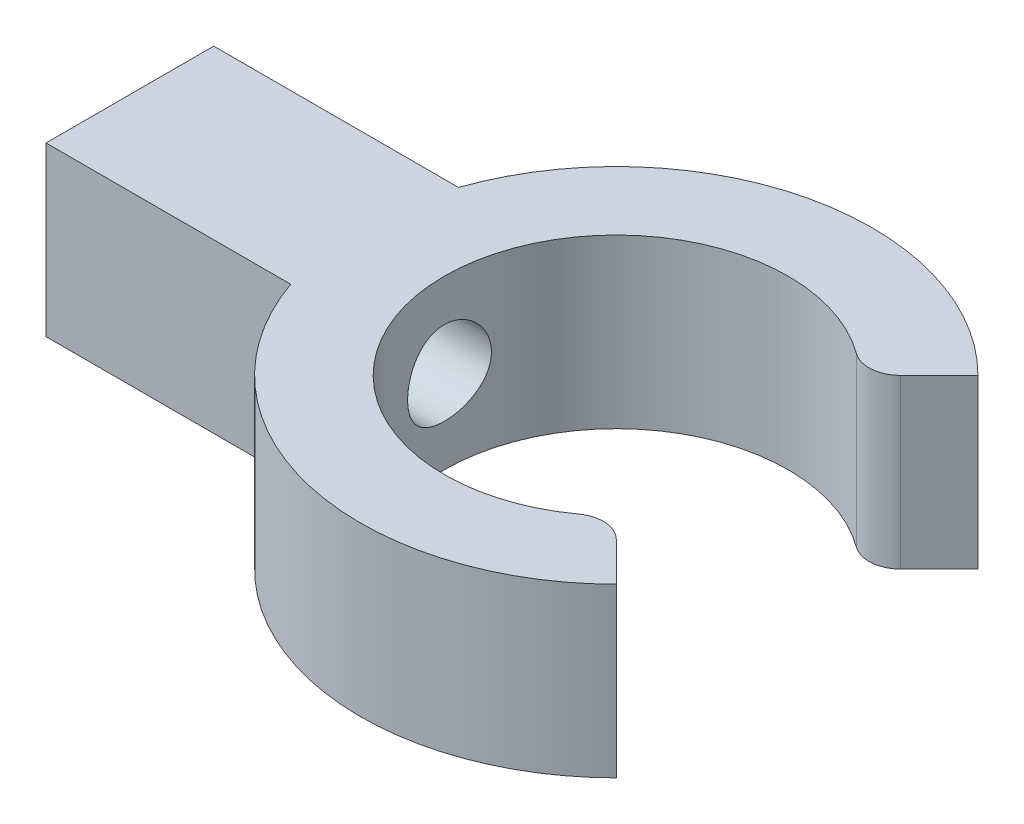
ISO-10303-21;
HEADER;
FILE_DESCRIPTION(('STEP AP214'),'2;1');
FILE_NAME('part.step','',(''),(''),'','','');
FILE_SCHEMA(('AUTOMOTIVE_DESIGN { 1 0 10303 214 1 1 1 1 }'));
ENDSEC;
DATA;
#1=APPLICATION_CONTEXT('core data for automotive mechanical design processes');
#2=APPLICATION_PROTOCOL_DEFINITION('international standard','automotive_design',2000,#1);
#3=PRODUCT_CONTEXT('',#1,'mechanical');
#4=PRODUCT('Part','Part','',(#3));
#5=PRODUCT_RELATED_PRODUCT_CATEGORY('part','',(#4));
#6=PRODUCT_DEFINITION_FORMATION('','',#4);
#7=PRODUCT_DEFINITION_CONTEXT('part definition',#1,'design');
#8=PRODUCT_DEFINITION('design','',#6,#7);
#9=PRODUCT_DEFINITION_SHAPE('','',#8);
#10=(LENGTH_UNIT() NAMED_UNIT(*) SI_UNIT(.MILLI.,.METRE.));
#11=(NAMED_UNIT(*) PLANE_ANGLE_UNIT() SI_UNIT($,.RADIAN.));
#12=(NAMED_UNIT(*) SI_UNIT($,.STERADIAN.) SOLID_ANGLE_UNIT());
#13=UNCERTAINTY_MEASURE_WITH_UNIT(LENGTH_MEASURE(1.E-05),#10,'distance_accuracy_value','');
#14=(GEOMETRIC_REPRESENTATION_CONTEXT(3) GLOBAL_UNCERTAINTY_ASSIGNED_CONTEXT((#13)) GLOBAL_UNIT_ASSIGNED_CONTEXT((#10,
#11,#12)) REPRESENTATION_CONTEXT('',''));
#15=CARTESIAN_POINT('',(0.,0.,0.));
#16=DIRECTION('',(0.,0.,1.));
#17=DIRECTION('',(1.,0.,0.));
#18=AXIS2_PLACEMENT_3D('',#15,#16,#17);
#19=CARTESIAN_POINT('',(15.7,8.,0.));
#20=DIRECTION('',(0.,-1.,0.));
#21=DIRECTION('',(0.,0.,-1.));
#22=AXIS2_PLACEMENT_3D('',#19,#20,#21);
#23=CYLINDRICAL_SURFACE('',#22,8.2);
#24=CARTESIAN_POINT('',(15.7,8.,0.));
#25=DIRECTION('',(0.,1.,0.));
#26=DIRECTION('',(0.,0.,1.));
#27=AXIS2_PLACEMENT_3D('',#24,#25,#26);
#28=CIRCLE('',#27,8.2);
#29=CARTESIAN_POINT('',(20.5318876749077,8.,-6.62516879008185));
#30=VERTEX_POINT('',#29);
#31=CARTESIAN_POINT('',(20.5318876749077,8.,6.62516879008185));
#32=VERTEX_POINT('',#31);
#33=EDGE_CURVE('E178',#30,#32,#28,.T.);
#34=ORIENTED_EDGE('',*,*,#33,.T.);
#35=DIRECTION('',(0.,-1.,0.));
#36=VECTOR('',#35,1.);
#37=CARTESIAN_POINT('',(20.5318876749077,8.,6.62516879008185));
#38=LINE('',#37,#36);
#39=CARTESIAN_POINT('',(20.5318876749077,0.,6.62516879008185));
#40=VERTEX_POINT('',#39);
#41=EDGE_CURVE('E156',#32,#40,#38,.T.);
#42=ORIENTED_EDGE('',*,*,#41,.T.);
#43=CARTESIAN_POINT('',(15.7,0.,0.));
#44=DIRECTION('',(0.,1.,0.));
#45=DIRECTION('',(0.,0.,1.));
#46=AXIS2_PLACEMENT_3D('',#43,#44,#45);
#47=CIRCLE('',#46,8.2);
#48=CARTESIAN_POINT('',(20.5318876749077,0.,-6.62516879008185));
#49=VERTEX_POINT('',#48);
#50=EDGE_CURVE('E193',#49,#40,#47,.T.);
#51=ORIENTED_EDGE('',*,*,#50,.F.);
#52=DIRECTION('',(0.,-1.,0.));
#53=VECTOR('',#52,1.);
#54=CARTESIAN_POINT('',(20.5318876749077,8.,-6.62516879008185));
#55=LINE('',#54,#53);
#56=EDGE_CURVE('E152',#49,#30,#55,.F.);
#57=ORIENTED_EDGE('',*,*,#56,.T.);
#58=EDGE_LOOP('',(#34,#42,#51,#57));
#59=FACE_BOUND('',#58,.T.);
#60=CARTESIAN_POINT('',(7.74764185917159,4.,-2.));
#61=CARTESIAN_POINT('',(7.7476397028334,3.88946701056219,-1.99999670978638));
#62=CARTESIAN_POINT('',(7.74531219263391,3.77889700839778,-1.99080563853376));
#63=CARTESIAN_POINT('',(7.73627602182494,3.56092589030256,-1.95433899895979));
#64=CARTESIAN_POINT('',(7.72956468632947,3.45352675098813,-1.92705238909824));
#65=CARTESIAN_POINT('',(7.71256515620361,3.24508170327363,-1.85532517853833));
#66=CARTESIAN_POINT('',(7.70228143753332,3.14402803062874,-1.81090603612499));
#67=CARTESIAN_POINT('',(7.67930138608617,2.95079774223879,-1.70623927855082));
#68=CARTESIAN_POINT('',(7.66660498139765,2.85862139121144,-1.64599119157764));
#69=CARTESIAN_POINT('',(7.63993239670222,2.68383060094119,-1.51002877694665));
#70=CARTESIAN_POINT('',(7.62593657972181,2.60142955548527,-1.43404391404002));
#71=CARTESIAN_POINT('',(7.59841280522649,2.45040613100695,-1.26934787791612));
#72=CARTESIAN_POINT('',(7.58488488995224,2.3817849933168,-1.1806355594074));
#73=CARTESIAN_POINT('',(7.55960456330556,2.25940211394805,-0.991547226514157));
#74=CARTESIAN_POINT('',(7.54787802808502,2.20584911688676,-0.891032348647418));
#75=CARTESIAN_POINT('',(7.52774530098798,2.11647856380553,-0.682093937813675));
#76=CARTESIAN_POINT('',(7.51933864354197,2.08065852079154,-0.573671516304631));
#77=CARTESIAN_POINT('',(7.50693168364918,2.02845167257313,-0.354219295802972));
#78=CARTESIAN_POINT('',(7.50284937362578,2.01170272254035,-0.243280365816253));
#79=CARTESIAN_POINT('',(7.49926563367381,1.99697766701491,-0.0200972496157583));
#80=CARTESIAN_POINT('',(7.49976355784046,1.99899891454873,0.0921467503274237));
#81=CARTESIAN_POINT('',(7.50522280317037,2.02149451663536,0.31224525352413));
#82=CARTESIAN_POINT('',(7.51008959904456,2.04157809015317,0.420142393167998));
#83=CARTESIAN_POINT('',(7.52363018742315,2.09900122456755,0.630986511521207));
#84=CARTESIAN_POINT('',(7.53230417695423,2.13634167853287,0.733933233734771));
#85=CARTESIAN_POINT('',(7.55263066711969,2.22754074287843,0.932995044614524));
#86=CARTESIAN_POINT('',(7.56430842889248,2.28154026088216,1.02904289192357));
#87=CARTESIAN_POINT('',(7.58937285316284,2.40441811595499,1.2108517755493));
#88=CARTESIAN_POINT('',(7.6027597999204,2.47329892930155,1.29661109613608));
#89=CARTESIAN_POINT('',(7.63018834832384,2.62608585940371,1.45773806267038));
#90=CARTESIAN_POINT('',(7.64423792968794,2.7103336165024,1.53278072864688));
#91=CARTESIAN_POINT('',(7.67109086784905,2.89036488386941,1.66774302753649));
#92=CARTESIAN_POINT('',(7.68389417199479,2.98614888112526,1.7276620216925));
#93=CARTESIAN_POINT('',(7.7068321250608,3.18714792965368,1.83087077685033));
#94=CARTESIAN_POINT('',(7.71695471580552,3.29240283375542,1.87408578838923));
#95=CARTESIAN_POINT('',(7.73322834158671,3.50898944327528,1.94210858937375));
#96=CARTESIAN_POINT('',(7.73938018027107,3.62031991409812,1.96692010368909));
#97=CARTESIAN_POINT('',(7.74684802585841,3.84289260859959,1.99689968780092));
#98=CARTESIAN_POINT('',(7.74828192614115,3.95406643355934,2.00254676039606));
#99=CARTESIAN_POINT('',(7.74647186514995,4.17576771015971,1.99534557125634));
#100=CARTESIAN_POINT('',(7.74322831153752,4.28629521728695,1.98249892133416));
#101=CARTESIAN_POINT('',(7.73254145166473,4.50181072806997,1.93909409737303));
#102=CARTESIAN_POINT('',(7.72516358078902,4.60685782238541,1.90881168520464));
#103=CARTESIAN_POINT('',(7.70710087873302,4.81038537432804,1.83169920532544));
#104=CARTESIAN_POINT('',(7.69641567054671,4.90886508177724,1.78486725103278));
#105=CARTESIAN_POINT('',(7.67269182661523,5.09850084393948,1.6749717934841));
#106=CARTESIAN_POINT('',(7.6596127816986,5.18948473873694,1.61162012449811));
#107=CARTESIAN_POINT('',(7.63267555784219,5.35970629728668,1.47085048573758));
#108=CARTESIAN_POINT('',(7.61881725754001,5.43894212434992,1.39343032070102));
#109=CARTESIAN_POINT('',(7.59148567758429,5.58534199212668,1.224529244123));
#110=CARTESIAN_POINT('',(7.57802929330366,5.65217563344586,1.13275871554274));
#111=CARTESIAN_POINT('',(7.55335856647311,5.76948200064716,0.939018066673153));
#112=CARTESIAN_POINT('',(7.54214410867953,5.81995556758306,0.837048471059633));
#113=CARTESIAN_POINT('',(7.5232904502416,5.90268168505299,0.62649947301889));
#114=CARTESIAN_POINT('',(7.51562608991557,5.93506280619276,0.517972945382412));
#115=CARTESIAN_POINT('',(7.50462629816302,5.98107455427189,0.296808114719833));
#116=CARTESIAN_POINT('',(7.50129007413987,5.99470861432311,0.184170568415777));
#117=CARTESIAN_POINT('',(7.49935301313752,6.00265392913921,-0.038908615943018));
#118=CARTESIAN_POINT('',(7.50063240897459,5.99745388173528,-0.149332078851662));
#119=CARTESIAN_POINT('',(7.50751908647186,5.96899256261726,-0.367681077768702));
#120=CARTESIAN_POINT('',(7.51312625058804,5.94573178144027,-0.475606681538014));
#121=CARTESIAN_POINT('',(7.5280218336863,5.88206603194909,-0.685411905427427));
#122=CARTESIAN_POINT('',(7.5372920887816,5.84174558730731,-0.787318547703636));
#123=CARTESIAN_POINT('',(7.55853503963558,5.74518248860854,-0.98297718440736));
#124=CARTESIAN_POINT('',(7.57050806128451,5.688937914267,-1.07672819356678));
#125=CARTESIAN_POINT('',(7.59620606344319,5.56061157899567,-1.25574567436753));
#126=CARTESIAN_POINT('',(7.60996497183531,5.48819568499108,-1.34076776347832));
#127=CARTESIAN_POINT('',(7.6375256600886,5.33023630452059,-1.49761929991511));
#128=CARTESIAN_POINT('',(7.65132744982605,5.24468953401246,-1.56944543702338));
#129=CARTESIAN_POINT('',(7.67768548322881,5.06109176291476,-1.69909803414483));
#130=CARTESIAN_POINT('',(7.69021565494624,4.9628478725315,-1.75665704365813));
#131=CARTESIAN_POINT('',(7.71226616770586,4.75778802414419,-1.85435557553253));
#132=CARTESIAN_POINT('',(7.7217887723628,4.65097858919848,-1.89450820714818));
#133=CARTESIAN_POINT('',(7.73520076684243,4.45357581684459,-1.95002833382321));
#134=CARTESIAN_POINT('',(7.73983195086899,4.36395543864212,-1.96872791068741));
#135=CARTESIAN_POINT('',(7.74605327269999,4.18289839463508,-1.99371462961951));
#136=CARTESIAN_POINT('',(7.74764364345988,4.09146186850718,-2.00000272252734));
#137=CARTESIAN_POINT('',(7.74764185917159,4.,-2.));
#138=B_SPLINE_CURVE_WITH_KNOTS('',3,(#60,#61,#62,#63,#64,#65,#66,#67,#68,#69,#70,#71,#72,#73,
#74,#75,#76,#77,#78,#79,#80,#81,#82,#83,#84,#85,#86,#87,#88,#89,#90,#91,#92,#93,#94,#95,#96,#97,
#98,#99,#100,#101,#102,#103,#104,#105,#106,#107,#108,#109,#110,#111,#112,#113,#114,#115,#116,
#117,#118,#119,#120,#121,#122,#123,#124,#125,#126,#127,#128,#129,#130,#131,#132,#133,#134,#135,
#136,#137),.UNSPECIFIED.,.T.,.F.,(4,2,2,2,2,2,2,2,2,2,2,2,2,2,2,2,2,2,2,2,2,2,2,2,2,2,2,2,2,2,2,
2,2,2,2,2,2,2,4),(0.,0.331263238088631,0.662728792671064,0.993780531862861,1.32484213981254,
1.66215439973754,1.9994970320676,2.34130561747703,2.6830662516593,3.01822284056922,
3.35333216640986,3.68136127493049,4.00940736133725,4.34030798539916,4.67126371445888,
5.01075340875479,5.35025743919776,5.691263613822,6.03220074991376,6.36455100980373,
6.69687230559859,7.02407662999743,7.3513182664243,7.68470220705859,8.01813821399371,
8.35947227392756,8.70078878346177,9.03964789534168,9.37844494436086,9.70851477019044,
10.0385756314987,10.3670199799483,10.6955039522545,11.0315339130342,11.3676480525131,
11.7096535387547,12.0514010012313,12.325529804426,12.5996376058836),.UNSPECIFIED.);
#139=CARTESIAN_POINT('',(7.74764185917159,4.,-2.));
#140=VERTEX_POINT('',#139);
#141=EDGE_CURVE('E251',#140,#140,#138,.T.);
#142=ORIENTED_EDGE('',*,*,#141,.T.);
#143=EDGE_LOOP('',(#142));
#144=FACE_BOUND('',#143,.T.);
#145=ADVANCED_FACE('F43',(#59,#144),#23,.F.);
#146=CARTESIAN_POINT('',(0.,8.,4.));
#147=DIRECTION('',(0.,0.,-1.));
#148=DIRECTION('',(-1.,0.,0.));
#149=AXIS2_PLACEMENT_3D('',#146,#147,#148);
#150=PLANE('',#149);
#151=DIRECTION('',(1.,0.,0.));
#152=VECTOR('',#151,1.);
#153=CARTESIAN_POINT('',(0.,0.,4.));
#154=LINE('',#153,#152);
#155=CARTESIAN_POINT('',(-7.5,0.,4.));
#156=VERTEX_POINT('',#155);
#157=CARTESIAN_POINT('',(4.17437637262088,0.,4.));
#158=VERTEX_POINT('',#157);
#159=EDGE_CURVE('E150',#156,#158,#154,.T.);
#160=ORIENTED_EDGE('',*,*,#159,.T.);
#161=DIRECTION('',(0.,-1.,0.));
#162=VECTOR('',#161,1.);
#163=CARTESIAN_POINT('',(4.17437637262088,8.,4.));
#164=LINE('',#163,#162);
#165=CARTESIAN_POINT('',(4.17437637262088,8.,4.));
#166=VERTEX_POINT('',#165);
#167=EDGE_CURVE('E130',#166,#158,#164,.T.);
#168=ORIENTED_EDGE('',*,*,#167,.F.);
#169=DIRECTION('',(1.,0.,0.));
#170=VECTOR('',#169,1.);
#171=CARTESIAN_POINT('',(0.,8.,4.));
#172=LINE('',#171,#170);
#173=CARTESIAN_POINT('',(-7.5,8.,4.));
#174=VERTEX_POINT('',#173);
#175=EDGE_CURVE('E136',#174,#166,#172,.T.);
#176=ORIENTED_EDGE('',*,*,#175,.F.);
#177=DIRECTION('',(0.,-1.,0.));
#178=VECTOR('',#177,1.);
#179=CARTESIAN_POINT('',(-7.5,8.,4.));
#180=LINE('',#179,#178);
#181=EDGE_CURVE('E218',#174,#156,#180,.T.);
#182=ORIENTED_EDGE('',*,*,#181,.T.);
#183=EDGE_LOOP('',(#160,#168,#176,#182));
#184=FACE_BOUND('',#183,.T.);
#185=ADVANCED_FACE('F148',(#184),#150,.F.);
#186=CARTESIAN_POINT('',(15.7,8.,0.));
#187=DIRECTION('',(0.,-1.,0.));
#188=DIRECTION('',(0.,0.,-1.));
#189=AXIS2_PLACEMENT_3D('',#186,#187,#188);
#190=CYLINDRICAL_SURFACE('',#189,12.2);
#191=CARTESIAN_POINT('',(15.7,0.,0.));
#192=DIRECTION('',(0.,1.,0.));
#193=DIRECTION('',(0.,0.,1.));
#194=AXIS2_PLACEMENT_3D('',#191,#192,#193);
#195=CIRCLE('',#194,12.2);
#196=CARTESIAN_POINT('',(24.3267027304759,0.,8.62670273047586));
#197=VERTEX_POINT('',#196);
#198=EDGE_CURVE('E196',#158,#197,#195,.T.);
#199=ORIENTED_EDGE('',*,*,#198,.T.);
#200=DIRECTION('',(0.,-1.,0.));
#201=VECTOR('',#200,1.);
#202=CARTESIAN_POINT('',(24.3267027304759,8.,8.62670273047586));
#203=LINE('',#202,#201);
#204=CARTESIAN_POINT('',(24.3267027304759,8.,8.62670273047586));
#205=VERTEX_POINT('',#204);
#206=EDGE_CURVE('E133',#205,#197,#203,.T.);
#207=ORIENTED_EDGE('',*,*,#206,.F.);
#208=CARTESIAN_POINT('',(15.7,8.,0.));
#209=DIRECTION('',(0.,1.,0.));
#210=DIRECTION('',(0.,0.,1.));
#211=AXIS2_PLACEMENT_3D('',#208,#209,#210);
#212=CIRCLE('',#211,12.2);
#213=EDGE_CURVE('E125',#166,#205,#212,.T.);
#214=ORIENTED_EDGE('',*,*,#213,.F.);
#215=ORIENTED_EDGE('',*,*,#167,.T.);
#216=EDGE_LOOP('',(#199,#207,#214,#215));
#217=FACE_BOUND('',#216,.T.);
#218=ADVANCED_FACE('F128',(#217),#190,.T.);
#219=CARTESIAN_POINT('',(7.84999999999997,8.,-7.85));
#220=DIRECTION('',(0.707106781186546,0.,-0.707106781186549));
#221=DIRECTION('',(-0.707106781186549,0.,-0.707106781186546));
#222=AXIS2_PLACEMENT_3D('',#219,#220,#221);
#223=PLANE('',#222);
#224=DIRECTION('',(0.707106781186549,0.,0.707106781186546));
#225=VECTOR('',#224,1.);
#226=CARTESIAN_POINT('',(7.84999999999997,0.,-7.85));
#227=LINE('',#226,#225);
#228=CARTESIAN_POINT('',(22.476429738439,0.,6.77642973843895));
#229=VERTEX_POINT('',#228);
#230=EDGE_CURVE('E192',#229,#197,#227,.T.);
#231=ORIENTED_EDGE('',*,*,#230,.F.);
#232=DIRECTION('',(0.,-1.,0.));
#233=VECTOR('',#232,1.);
#234=CARTESIAN_POINT('',(22.476429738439,8.,6.77642973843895));
#235=LINE('',#234,#233);
#236=CARTESIAN_POINT('',(22.476429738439,8.,6.77642973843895));
#237=VERTEX_POINT('',#236);
#238=EDGE_CURVE('E68',#229,#237,#235,.F.);
#239=ORIENTED_EDGE('',*,*,#238,.T.);
#240=DIRECTION('',(0.707106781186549,0.,0.707106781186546));
#241=VECTOR('',#240,1.);
#242=CARTESIAN_POINT('',(7.84999999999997,8.,-7.85));
#243=LINE('',#242,#241);
#244=EDGE_CURVE('E135',#237,#205,#243,.T.);
#245=ORIENTED_EDGE('',*,*,#244,.T.);
#246=ORIENTED_EDGE('',*,*,#206,.T.);
#247=EDGE_LOOP('',(#231,#239,#245,#246));
#248=FACE_BOUND('',#247,.T.);
#249=ADVANCED_FACE('F194',(#248),#223,.T.);
#250=CARTESIAN_POINT('',(7.84999999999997,8.,7.85));
#251=DIRECTION('',(-0.707106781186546,0.,-0.707106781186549));
#252=DIRECTION('',(-0.707106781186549,0.,0.707106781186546));
#253=AXIS2_PLACEMENT_3D('',#250,#251,#252);
#254=PLANE('',#253);
#255=DIRECTION('',(0.707106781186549,0.,-0.707106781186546));
#256=VECTOR('',#255,1.);
#257=CARTESIAN_POINT('',(7.84999999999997,8.,7.85));
#258=LINE('',#257,#256);
#259=CARTESIAN_POINT('',(22.476429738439,8.,-6.77642973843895));
#260=VERTEX_POINT('',#259);
#261=CARTESIAN_POINT('',(24.3267027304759,8.,-8.62670273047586));
#262=VERTEX_POINT('',#261);
#263=EDGE_CURVE('E187',#260,#262,#258,.T.);
#264=ORIENTED_EDGE('',*,*,#263,.F.);
#265=DIRECTION('',(0.,1.,0.));
#266=VECTOR('',#265,1.);
#267=CARTESIAN_POINT('',(22.476429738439,0.,-6.77642973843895));
#268=LINE('',#267,#266);
#269=CARTESIAN_POINT('',(22.476429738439,0.,-6.77642973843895));
#270=VERTEX_POINT('',#269);
#271=EDGE_CURVE('E11',#260,#270,#268,.F.);
#272=ORIENTED_EDGE('',*,*,#271,.T.);
#273=DIRECTION('',(0.707106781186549,0.,-0.707106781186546));
#274=VECTOR('',#273,1.);
#275=CARTESIAN_POINT('',(7.84999999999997,0.,7.85));
#276=LINE('',#275,#274);
#277=CARTESIAN_POINT('',(24.3267027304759,0.,-8.62670273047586));
#278=VERTEX_POINT('',#277);
#279=EDGE_CURVE('E200',#270,#278,#276,.T.);
#280=ORIENTED_EDGE('',*,*,#279,.T.);
#281=DIRECTION('',(0.,-1.,0.));
#282=VECTOR('',#281,1.);
#283=CARTESIAN_POINT('',(24.3267027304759,8.,-8.62670273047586));
#284=LINE('',#283,#282);
#285=EDGE_CURVE('E158',#262,#278,#284,.T.);
#286=ORIENTED_EDGE('',*,*,#285,.F.);
#287=EDGE_LOOP('',(#264,#272,#280,#286));
#288=FACE_BOUND('',#287,.T.);
#289=ADVANCED_FACE('F282',(#288),#254,.F.);
#290=CARTESIAN_POINT('',(15.7,8.,0.));
#291=DIRECTION('',(0.,-1.,0.));
#292=DIRECTION('',(0.,0.,-1.));
#293=AXIS2_PLACEMENT_3D('',#290,#291,#292);
#294=CYLINDRICAL_SURFACE('',#293,12.2);
#295=CARTESIAN_POINT('',(15.7,0.,0.));
#296=DIRECTION('',(0.,1.,0.));
#297=DIRECTION('',(0.,0.,1.));
#298=AXIS2_PLACEMENT_3D('',#295,#296,#297);
#299=CIRCLE('',#298,12.2);
#300=CARTESIAN_POINT('',(4.17437637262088,0.,-4.));
#301=VERTEX_POINT('',#300);
#302=EDGE_CURVE('E207',#278,#301,#299,.T.);
#303=ORIENTED_EDGE('',*,*,#302,.T.);
#304=DIRECTION('',(0.,-1.,0.));
#305=VECTOR('',#304,1.);
#306=CARTESIAN_POINT('',(4.17437637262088,8.,-4.));
#307=LINE('',#306,#305);
#308=CARTESIAN_POINT('',(4.17437637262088,8.,-4.));
#309=VERTEX_POINT('',#308);
#310=EDGE_CURVE('E224',#309,#301,#307,.T.);
#311=ORIENTED_EDGE('',*,*,#310,.F.);
#312=CARTESIAN_POINT('',(15.7,8.,0.));
#313=DIRECTION('',(0.,1.,0.));
#314=DIRECTION('',(0.,0.,1.));
#315=AXIS2_PLACEMENT_3D('',#312,#313,#314);
#316=CIRCLE('',#315,12.2);
#317=EDGE_CURVE('E234',#262,#309,#316,.T.);
#318=ORIENTED_EDGE('',*,*,#317,.F.);
#319=ORIENTED_EDGE('',*,*,#285,.T.);
#320=EDGE_LOOP('',(#303,#311,#318,#319));
#321=FACE_BOUND('',#320,.T.);
#322=ADVANCED_FACE('F232',(#321),#294,.T.);
#323=CARTESIAN_POINT('',(0.,8.,-4.));
#324=DIRECTION('',(0.,0.,-1.));
#325=DIRECTION('',(-1.,0.,0.));
#326=AXIS2_PLACEMENT_3D('',#323,#324,#325);
#327=PLANE('',#326);
#328=DIRECTION('',(1.,0.,0.));
#329=VECTOR('',#328,1.);
#330=CARTESIAN_POINT('',(0.,0.,-4.));
#331=LINE('',#330,#329);
#332=CARTESIAN_POINT('',(-7.5,0.,-4.));
#333=VERTEX_POINT('',#332);
#334=EDGE_CURVE('E211',#333,#301,#331,.T.);
#335=ORIENTED_EDGE('',*,*,#334,.F.);
#336=DIRECTION('',(0.,-1.,0.));
#337=VECTOR('',#336,1.);
#338=CARTESIAN_POINT('',(-7.5,8.,-4.));
#339=LINE('',#338,#337);
#340=CARTESIAN_POINT('',(-7.5,8.,-4.));
#341=VERTEX_POINT('',#340);
#342=EDGE_CURVE('E221',#341,#333,#339,.T.);
#343=ORIENTED_EDGE('',*,*,#342,.F.);
#344=DIRECTION('',(1.,0.,0.));
#345=VECTOR('',#344,1.);
#346=CARTESIAN_POINT('',(0.,8.,-4.));
#347=LINE('',#346,#345);
#348=EDGE_CURVE('E242',#341,#309,#347,.T.);
#349=ORIENTED_EDGE('',*,*,#348,.T.);
#350=ORIENTED_EDGE('',*,*,#310,.T.);
#351=EDGE_LOOP('',(#335,#343,#349,#350));
#352=FACE_BOUND('',#351,.T.);
#353=ADVANCED_FACE('F240',(#352),#327,.T.);
#354=CARTESIAN_POINT('',(-7.5,8.,0.));
#355=DIRECTION('',(-1.,0.,0.));
#356=DIRECTION('',(0.,0.,1.));
#357=AXIS2_PLACEMENT_3D('',#354,#355,#356);
#358=PLANE('',#357);
#359=CARTESIAN_POINT('',(-7.5,4.,0.));
#360=DIRECTION('',(-1.,0.,0.));
#361=DIRECTION('',(0.,0.,1.));
#362=AXIS2_PLACEMENT_3D('',#359,#360,#361);
#363=CIRCLE('',#362,2.);
#364=CARTESIAN_POINT('',(-7.5,4.,2.));
#365=VERTEX_POINT('',#364);
#366=EDGE_CURVE('E47',#365,#365,#363,.F.);
#367=ORIENTED_EDGE('',*,*,#366,.T.);
#368=EDGE_LOOP('',(#367));
#369=FACE_BOUND('',#368,.T.);
#370=DIRECTION('',(0.,0.,-1.));
#371=VECTOR('',#370,1.);
#372=CARTESIAN_POINT('',(-7.5,0.,0.));
#373=LINE('',#372,#371);
#374=EDGE_CURVE('E146',#156,#333,#373,.T.);
#375=ORIENTED_EDGE('',*,*,#374,.F.);
#376=ORIENTED_EDGE('',*,*,#181,.F.);
#377=DIRECTION('',(0.,0.,-1.));
#378=VECTOR('',#377,1.);
#379=CARTESIAN_POINT('',(-7.5,8.,0.));
#380=LINE('',#379,#378);
#381=EDGE_CURVE('E143',#174,#341,#380,.T.);
#382=ORIENTED_EDGE('',*,*,#381,.T.);
#383=ORIENTED_EDGE('',*,*,#342,.T.);
#384=EDGE_LOOP('',(#375,#376,#382,#383));
#385=FACE_BOUND('',#384,.T.);
#386=ADVANCED_FACE('F273',(#369,#385),#358,.T.);
#387=CARTESIAN_POINT('',(0.,8.,0.));
#388=DIRECTION('',(0.,1.,0.));
#389=DIRECTION('',(0.,0.,1.));
#390=AXIS2_PLACEMENT_3D('',#387,#388,#389);
#391=PLANE('',#390);
#392=ORIENTED_EDGE('',*,*,#244,.F.);
#393=CARTESIAN_POINT('',(21.4157695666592,8.,7.83708991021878));
#394=DIRECTION('',(0.,1.,0.));
#395=DIRECTION('',(0.,0.,1.));
#396=AXIS2_PLACEMENT_3D('',#393,#394,#395);
#397=CIRCLE('',#396,1.5);
#398=EDGE_CURVE('E53',#237,#32,#397,.T.);
#399=ORIENTED_EDGE('',*,*,#398,.T.);
#400=ORIENTED_EDGE('',*,*,#33,.F.);
#401=CARTESIAN_POINT('',(21.4157695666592,8.,-7.83708991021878));
#402=DIRECTION('',(0.,1.,0.));
#403=DIRECTION('',(0.,0.,1.));
#404=AXIS2_PLACEMENT_3D('',#401,#402,#403);
#405=CIRCLE('',#404,1.5);
#406=EDGE_CURVE('E60',#30,#260,#405,.T.);
#407=ORIENTED_EDGE('',*,*,#406,.T.);
#408=ORIENTED_EDGE('',*,*,#263,.T.);
#409=ORIENTED_EDGE('',*,*,#317,.T.);
#410=ORIENTED_EDGE('',*,*,#348,.F.);
#411=ORIENTED_EDGE('',*,*,#381,.F.);
#412=ORIENTED_EDGE('',*,*,#175,.T.);
#413=ORIENTED_EDGE('',*,*,#213,.T.);
#414=EDGE_LOOP('',(#392,#399,#400,#407,#408,#409,#410,#411,#412,#413));
#415=FACE_BOUND('',#414,.T.);
#416=ADVANCED_FACE('F140',(#415),#391,.T.);
#417=CARTESIAN_POINT('',(0.,0.,0.));
#418=DIRECTION('',(0.,1.,0.));
#419=DIRECTION('',(0.,0.,1.));
#420=AXIS2_PLACEMENT_3D('',#417,#418,#419);
#421=PLANE('',#420);
#422=ORIENTED_EDGE('',*,*,#50,.T.);
#423=CARTESIAN_POINT('',(21.4157695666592,0.,7.83708991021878));
#424=DIRECTION('',(0.,1.,0.));
#425=DIRECTION('',(0.,0.,1.));
#426=AXIS2_PLACEMENT_3D('',#423,#424,#425);
#427=CIRCLE('',#426,1.5);
#428=EDGE_CURVE('E168',#40,#229,#427,.F.);
#429=ORIENTED_EDGE('',*,*,#428,.T.);
#430=ORIENTED_EDGE('',*,*,#230,.T.);
#431=ORIENTED_EDGE('',*,*,#198,.F.);
#432=ORIENTED_EDGE('',*,*,#159,.F.);
#433=ORIENTED_EDGE('',*,*,#374,.T.);
#434=ORIENTED_EDGE('',*,*,#334,.T.);
#435=ORIENTED_EDGE('',*,*,#302,.F.);
#436=ORIENTED_EDGE('',*,*,#279,.F.);
#437=CARTESIAN_POINT('',(21.4157695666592,0.,-7.83708991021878));
#438=DIRECTION('',(0.,1.,0.));
#439=DIRECTION('',(0.,0.,1.));
#440=AXIS2_PLACEMENT_3D('',#437,#438,#439);
#441=CIRCLE('',#440,1.5);
#442=EDGE_CURVE('E165',#270,#49,#441,.F.);
#443=ORIENTED_EDGE('',*,*,#442,.T.);
#444=EDGE_LOOP('',(#422,#429,#430,#431,#432,#433,#434,#435,#436,#443));
#445=FACE_BOUND('',#444,.T.);
#446=ADVANCED_FACE('F191',(#445),#421,.F.);
#447=CARTESIAN_POINT('',(21.4157695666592,8.,7.83708991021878));
#448=DIRECTION('',(0.,-1.,0.));
#449=DIRECTION('',(0.,0.,-1.));
#450=AXIS2_PLACEMENT_3D('',#447,#448,#449);
#451=CYLINDRICAL_SURFACE('',#450,1.5);
#452=ORIENTED_EDGE('',*,*,#398,.F.);
#453=ORIENTED_EDGE('',*,*,#238,.F.);
#454=ORIENTED_EDGE('',*,*,#428,.F.);
#455=ORIENTED_EDGE('',*,*,#41,.F.);
#456=EDGE_LOOP('',(#452,#453,#454,#455));
#457=FACE_BOUND('',#456,.T.);
#458=ADVANCED_FACE('F189',(#457),#451,.T.);
#459=CARTESIAN_POINT('',(21.4157695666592,8.,-7.83708991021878));
#460=DIRECTION('',(0.,-1.,0.));
#461=DIRECTION('',(0.,0.,-1.));
#462=AXIS2_PLACEMENT_3D('',#459,#460,#461);
#463=CYLINDRICAL_SURFACE('',#462,1.5);
#464=ORIENTED_EDGE('',*,*,#406,.F.);
#465=ORIENTED_EDGE('',*,*,#56,.F.);
#466=ORIENTED_EDGE('',*,*,#442,.F.);
#467=ORIENTED_EDGE('',*,*,#271,.F.);
#468=EDGE_LOOP('',(#464,#465,#466,#467));
#469=FACE_BOUND('',#468,.T.);
#470=ADVANCED_FACE('F45',(#469),#463,.T.);
#471=CARTESIAN_POINT('',(-7.500012,4.,0.));
#472=DIRECTION('',(1.,0.,0.));
#473=DIRECTION('',(0.,0.,-1.));
#474=AXIS2_PLACEMENT_3D('',#471,#472,#473);
#475=CYLINDRICAL_SURFACE('',#474,2.);
#476=ORIENTED_EDGE('',*,*,#141,.F.);
#477=EDGE_LOOP('',(#476));
#478=FACE_BOUND('',#477,.T.);
#479=ORIENTED_EDGE('',*,*,#366,.F.);
#480=EDGE_LOOP('',(#479));
#481=FACE_BOUND('',#480,.T.);
#482=ADVANCED_FACE('F266',(#478,#481),#475,.F.);
#483=CLOSED_SHELL('',(#145,#185,#218,#249,#289,#322,#353,#386,#416,#446,#458,#470,#482));
#484=MANIFOLD_SOLID_BREP('B2',#483);
#485=ADVANCED_BREP_SHAPE_REPRESENTATION('',(#18,#484),#14);
#486=SHAPE_DEFINITION_REPRESENTATION(#9,#485);
ENDSEC;
END-ISO-10303-21;
